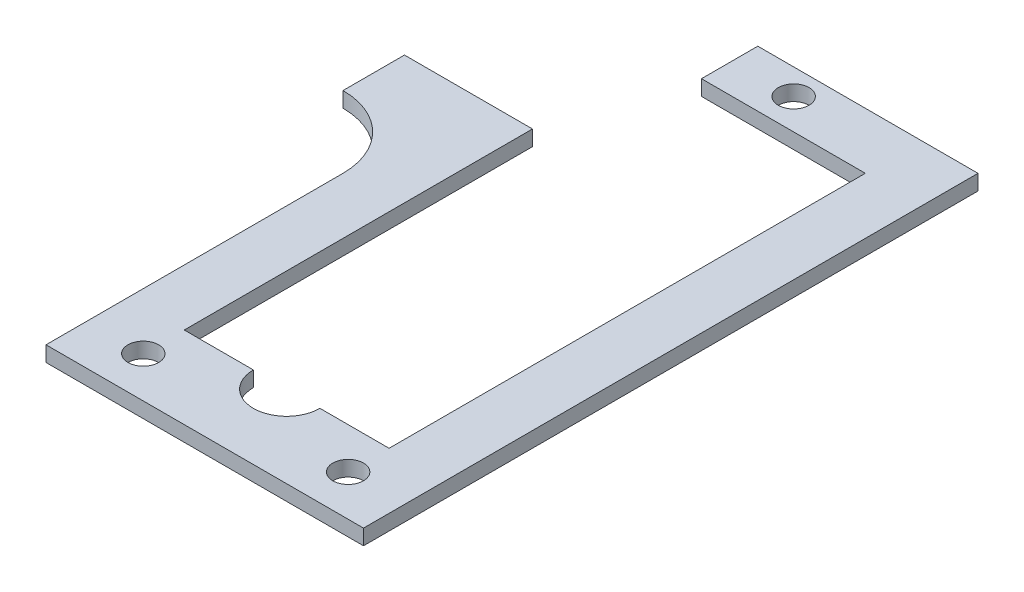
from build123d import *

# Parameters (mm, degrees)
SKETCH1_R      = 3
EXTRUDE1_DEPTH = 3


with BuildPart() as part:
    # Sketch1 → Extrude1 (new body)
    with BuildSketch(Plane(origin=(0, 0, 0), x_dir=(1, 0, 0), z_dir=(0, 1, 0))):
        with BuildLine():
            Line((0, 0), (62, 0))
            Line((62, 0), (62, 120))
            Line((62, 120), (19, 120))
            Line((19, 120), (19, 109))
            Line((19, 109), (51, 109))
            Line((51, 109), (51, 16))
            Line((51, 16), (37.5, 16))
            ThreePointArc((37.5, 16), (31, 9.5), (24.5, 16))
            Line((24.5, 16), (11, 16))
            Line((11, 16), (11, 84))
            Line((11, 84), (-14, 84))
            Line((-14, 84), (-14, 72))
            ThreePointArc((-14, 72), (-4.100505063, 67.899494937), (0, 58))
            Line((0, 58), (0, 0))
        make_face()
        with Locations(Location((11, 8, 0), (0, 0, 270))):
            Circle(SKETCH1_R, mode=Mode.SUBTRACT)
        with Locations(Location((51, 8, 0), (0, 0, 270))):
            Circle(SKETCH1_R, mode=Mode.SUBTRACT)
        with Locations(Location((31, 115, 0), (0, 0, 270))):
            Circle(SKETCH1_R, mode=Mode.SUBTRACT)
    extrude(amount=EXTRUDE1_DEPTH)


solid = part.part
